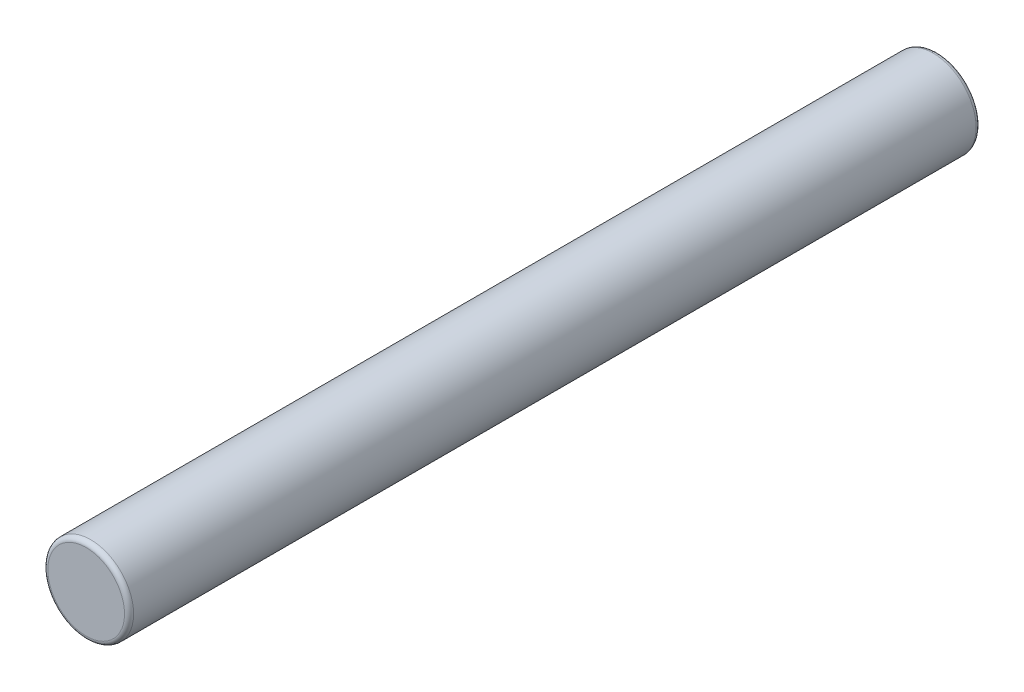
ISO-10303-21;
HEADER;
FILE_DESCRIPTION(('STEP AP214'),'2;1');
FILE_NAME('part.step','',(''),(''),'','','');
FILE_SCHEMA(('AUTOMOTIVE_DESIGN { 1 0 10303 214 1 1 1 1 }'));
ENDSEC;
DATA;
#1=APPLICATION_CONTEXT('core data for automotive mechanical design processes');
#2=APPLICATION_PROTOCOL_DEFINITION('international standard','automotive_design',2000,#1);
#3=PRODUCT_CONTEXT('',#1,'mechanical');
#4=PRODUCT('Part','Part','',(#3));
#5=PRODUCT_RELATED_PRODUCT_CATEGORY('part','',(#4));
#6=PRODUCT_DEFINITION_FORMATION('','',#4);
#7=PRODUCT_DEFINITION_CONTEXT('part definition',#1,'design');
#8=PRODUCT_DEFINITION('design','',#6,#7);
#9=PRODUCT_DEFINITION_SHAPE('','',#8);
#10=(LENGTH_UNIT() NAMED_UNIT(*) SI_UNIT(.MILLI.,.METRE.));
#11=(NAMED_UNIT(*) PLANE_ANGLE_UNIT() SI_UNIT($,.RADIAN.));
#12=(NAMED_UNIT(*) SI_UNIT($,.STERADIAN.) SOLID_ANGLE_UNIT());
#13=UNCERTAINTY_MEASURE_WITH_UNIT(LENGTH_MEASURE(1.E-05),#10,'distance_accuracy_value','');
#14=(GEOMETRIC_REPRESENTATION_CONTEXT(3) GLOBAL_UNCERTAINTY_ASSIGNED_CONTEXT((#13)) GLOBAL_UNIT_ASSIGNED_CONTEXT((#10,
#11,#12)) REPRESENTATION_CONTEXT('',''));
#15=CARTESIAN_POINT('',(0.,0.,0.));
#16=DIRECTION('',(0.,0.,1.));
#17=DIRECTION('',(1.,0.,0.));
#18=AXIS2_PLACEMENT_3D('',#15,#16,#17);
#19=CARTESIAN_POINT('',(0.,0.,11.9126));
#20=DIRECTION('',(0.,0.,-1.));
#21=DIRECTION('',(-1.,0.,0.));
#22=AXIS2_PLACEMENT_3D('',#19,#20,#21);
#23=CYLINDRICAL_SURFACE('',#22,1.20015);
#24=CARTESIAN_POINT('',(0.,0.,11.7856));
#25=DIRECTION('',(0.,0.,1.));
#26=DIRECTION('',(1.,0.,0.));
#27=AXIS2_PLACEMENT_3D('',#24,#25,#26);
#28=CIRCLE('',#27,1.20015);
#29=CARTESIAN_POINT('',(1.20015,0.,11.7856));
#30=VERTEX_POINT('',#29);
#31=EDGE_CURVE('E37',#30,#30,#28,.F.);
#32=ORIENTED_EDGE('',*,*,#31,.T.);
#33=EDGE_LOOP('',(#32));
#34=FACE_BOUND('',#33,.T.);
#35=CARTESIAN_POINT('',(0.,0.,-11.7856));
#36=DIRECTION('',(0.,0.,1.));
#37=DIRECTION('',(1.,0.,0.));
#38=AXIS2_PLACEMENT_3D('',#35,#36,#37);
#39=CIRCLE('',#38,1.20015);
#40=CARTESIAN_POINT('',(1.20015,0.,-11.7856));
#41=VERTEX_POINT('',#40);
#42=EDGE_CURVE('E41',#41,#41,#39,.T.);
#43=ORIENTED_EDGE('',*,*,#42,.T.);
#44=EDGE_LOOP('',(#43));
#45=FACE_BOUND('',#44,.T.);
#46=ADVANCED_FACE('F30',(#34,#45),#23,.T.);
#47=CARTESIAN_POINT('',(0.,0.,11.9126));
#48=DIRECTION('',(0.,0.,1.));
#49=DIRECTION('',(1.,0.,0.));
#50=AXIS2_PLACEMENT_3D('',#47,#48,#49);
#51=PLANE('',#50);
#52=CARTESIAN_POINT('',(0.,0.,11.9126));
#53=DIRECTION('',(0.,0.,1.));
#54=DIRECTION('',(1.,0.,0.));
#55=AXIS2_PLACEMENT_3D('',#52,#53,#54);
#56=CIRCLE('',#55,1.07315);
#57=CARTESIAN_POINT('',(1.07315,0.,11.9126));
#58=VERTEX_POINT('',#57);
#59=EDGE_CURVE('E45',#58,#58,#56,.T.);
#60=ORIENTED_EDGE('',*,*,#59,.T.);
#61=EDGE_LOOP('',(#60));
#62=FACE_BOUND('',#61,.T.);
#63=ADVANCED_FACE('F51',(#62),#51,.T.);
#64=CARTESIAN_POINT('',(0.,0.,-11.9126));
#65=DIRECTION('',(0.,0.,1.));
#66=DIRECTION('',(1.,0.,0.));
#67=AXIS2_PLACEMENT_3D('',#64,#65,#66);
#68=PLANE('',#67);
#69=CARTESIAN_POINT('',(0.,0.,-11.9126));
#70=DIRECTION('',(0.,0.,1.));
#71=DIRECTION('',(1.,0.,0.));
#72=AXIS2_PLACEMENT_3D('',#69,#70,#71);
#73=CIRCLE('',#72,1.07315);
#74=CARTESIAN_POINT('',(1.07315,0.,-11.9126));
#75=VERTEX_POINT('',#74);
#76=EDGE_CURVE('E10',#75,#75,#73,.F.);
#77=ORIENTED_EDGE('',*,*,#76,.T.);
#78=EDGE_LOOP('',(#77));
#79=FACE_BOUND('',#78,.T.);
#80=ADVANCED_FACE('F55',(#79),#68,.F.);
#81=CARTESIAN_POINT('',(0.,0.,11.7856));
#82=DIRECTION('',(0.,0.,1.));
#83=DIRECTION('',(1.,0.,0.));
#84=AXIS2_PLACEMENT_3D('',#81,#82,#83);
#85=TOROIDAL_SURFACE('',#84,1.07315,0.127);
#86=ORIENTED_EDGE('',*,*,#31,.F.);
#87=EDGE_LOOP('',(#86));
#88=FACE_BOUND('',#87,.T.);
#89=ORIENTED_EDGE('',*,*,#59,.F.);
#90=EDGE_LOOP('',(#89));
#91=FACE_BOUND('',#90,.T.);
#92=ADVANCED_FACE('F53',(#88,#91),#85,.T.);
#93=CARTESIAN_POINT('',(0.,0.,-11.7856));
#94=DIRECTION('',(0.,0.,1.));
#95=DIRECTION('',(1.,0.,0.));
#96=AXIS2_PLACEMENT_3D('',#93,#94,#95);
#97=TOROIDAL_SURFACE('',#96,1.07315,0.127);
#98=ORIENTED_EDGE('',*,*,#76,.F.);
#99=EDGE_LOOP('',(#98));
#100=FACE_BOUND('',#99,.T.);
#101=ORIENTED_EDGE('',*,*,#42,.F.);
#102=EDGE_LOOP('',(#101));
#103=FACE_BOUND('',#102,.T.);
#104=ADVANCED_FACE('F32',(#100,#103),#97,.T.);
#105=CLOSED_SHELL('',(#46,#63,#80,#92,#104));
#106=MANIFOLD_SOLID_BREP('B2',#105);
#107=ADVANCED_BREP_SHAPE_REPRESENTATION('',(#18,#106),#14);
#108=SHAPE_DEFINITION_REPRESENTATION(#9,#107);
ENDSEC;
END-ISO-10303-21;
